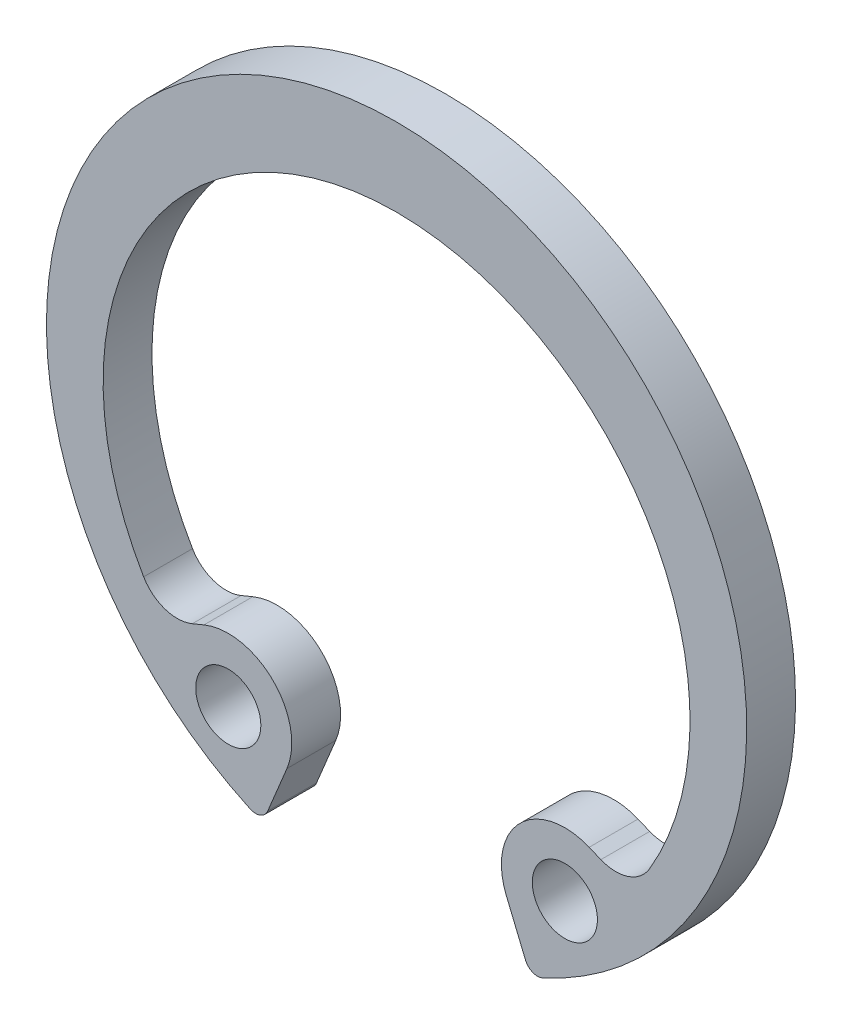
from build123d import *

# Parameters (mm, degrees)
BODYSKE_R      = 1
BASEBODY_DEPTH = 1.5
FILLET1_R      = 1.2
FILLET2_R      = 0.4


with BuildPart() as part:
    # BodySke → BaseBody (new body)
    with BuildSketch(Plane.XY):
        with BuildLine():
            Line((3.36631453, -8.127002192), (4.113846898, -9.931704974))
            ThreePointArc((4.113846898, -9.931704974), (0, 10.75), (-4.113846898, -9.931704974))
            Line((-4.113846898, -9.931704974), (-3.36631453, -8.127002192))
            ThreePointArc((-3.36631453, -8.127002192), (-3.788874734, -6.00264859), (-5.913228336, -5.580088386))
            Line((-5.913228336, -5.580088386), (-7.179036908, -6.104403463))
            ThreePointArc((-7.179036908, -6.104403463), (0, 8.35), (7.179036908, -6.104403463))
            Line((7.179036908, -6.104403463), (5.913228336, -5.580088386))
            ThreePointArc((5.913228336, -5.580088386), (3.788874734, -6.00264859), (3.36631453, -8.127002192))
        make_face()
        with Locations((5.167254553, -7.381028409)):
            Circle(BODYSKE_R, mode=Mode.SUBTRACT)
        with Locations((-5.167254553, -7.381028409)):
            Circle(BODYSKE_R, mode=Mode.SUBTRACT)
    extrude(amount=BASEBODY_DEPTH)

    # Fillet1
    fillet1_edges = [part.edges().sort_by_distance(p)[0] for p in [
        (7.179036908, -6.104403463, 0.75),
        (-7.179036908, -6.104403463, 0.75),
    ]]
    fillet(fillet1_edges, radius=FILLET1_R)

    # Fillet2
    fillet2_edges = [part.edges().sort_by_distance(p)[0] for p in [
        (-4.113846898, -9.931704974, 0.75),
        (4.113846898, -9.931704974, 0.75),
    ]]
    fillet(fillet2_edges, radius=FILLET2_R)


solid = part.part
